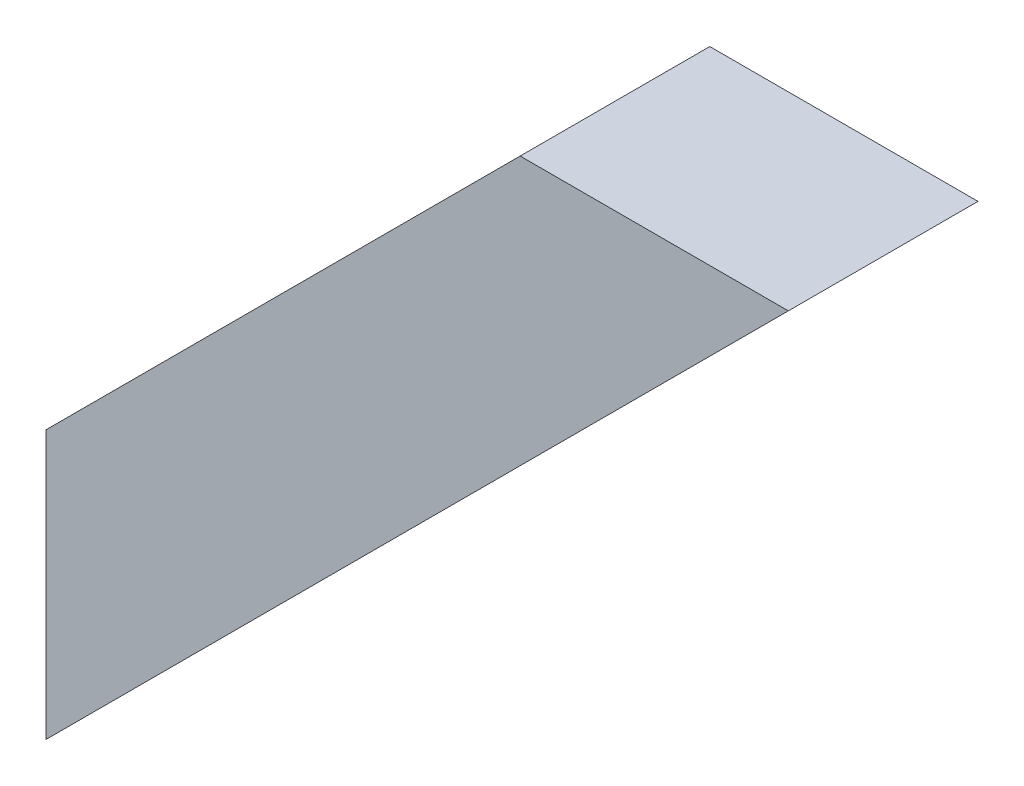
from build123d import *

# Parameters (mm, degrees)
BOSS_EXTRU_1_DEPTH = 120


with BuildPart() as part:
    # Esquisse1 → Boss.-Extru.1 (new body)
    with BuildSketch(Plane.XY):
        Polygon((0, -300), (300, 0), (469.705627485, 0), (84.852813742, -384.852813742), (0, -469.705627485), align=None)
    extrude(amount=BOSS_EXTRU_1_DEPTH)


solid = part.part
